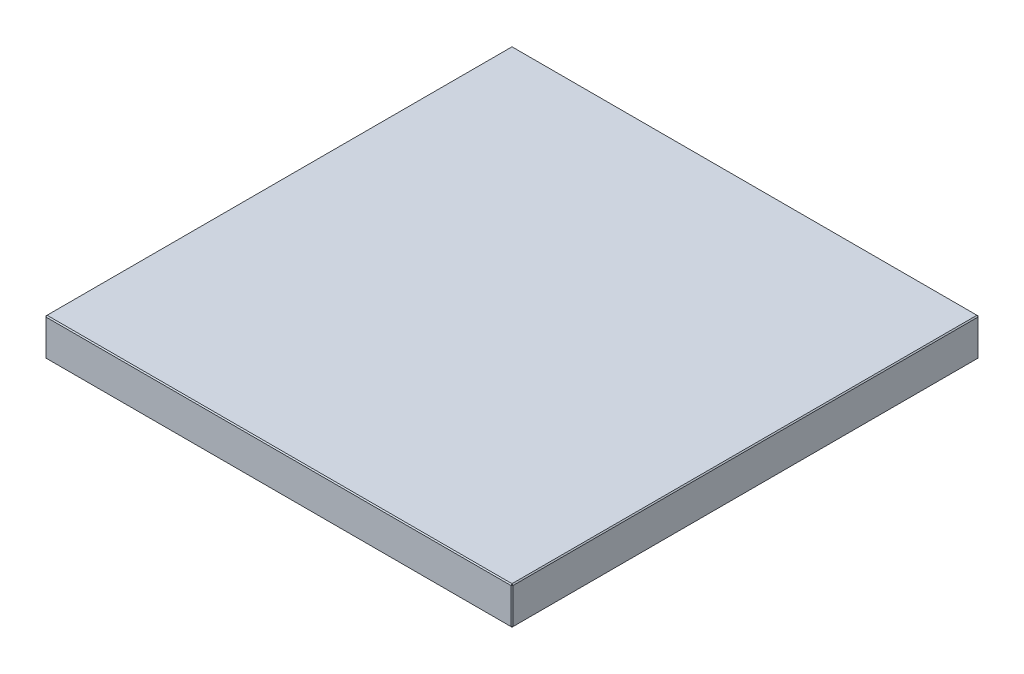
ISO-10303-21;
HEADER;
FILE_DESCRIPTION(('STEP AP214'),'2;1');
FILE_NAME('part.step','',(''),(''),'','','');
FILE_SCHEMA(('AUTOMOTIVE_DESIGN { 1 0 10303 214 1 1 1 1 }'));
ENDSEC;
DATA;
#1=APPLICATION_CONTEXT('core data for automotive mechanical design processes');
#2=APPLICATION_PROTOCOL_DEFINITION('international standard','automotive_design',2000,#1);
#3=PRODUCT_CONTEXT('',#1,'mechanical');
#4=PRODUCT('Part','Part','',(#3));
#5=PRODUCT_RELATED_PRODUCT_CATEGORY('part','',(#4));
#6=PRODUCT_DEFINITION_FORMATION('','',#4);
#7=PRODUCT_DEFINITION_CONTEXT('part definition',#1,'design');
#8=PRODUCT_DEFINITION('design','',#6,#7);
#9=PRODUCT_DEFINITION_SHAPE('','',#8);
#10=(LENGTH_UNIT() NAMED_UNIT(*) SI_UNIT(.MILLI.,.METRE.));
#11=(NAMED_UNIT(*) PLANE_ANGLE_UNIT() SI_UNIT($,.RADIAN.));
#12=(NAMED_UNIT(*) SI_UNIT($,.STERADIAN.) SOLID_ANGLE_UNIT());
#13=UNCERTAINTY_MEASURE_WITH_UNIT(LENGTH_MEASURE(1.E-05),#10,'distance_accuracy_value','');
#14=(GEOMETRIC_REPRESENTATION_CONTEXT(3) GLOBAL_UNCERTAINTY_ASSIGNED_CONTEXT((#13)) GLOBAL_UNIT_ASSIGNED_CONTEXT((#10,
#11,#12)) REPRESENTATION_CONTEXT('',''));
#15=CARTESIAN_POINT('',(0.,0.,0.));
#16=DIRECTION('',(0.,0.,1.));
#17=DIRECTION('',(1.,0.,0.));
#18=AXIS2_PLACEMENT_3D('',#15,#16,#17);
#19=CARTESIAN_POINT('',(-223.,36.,223.));
#20=DIRECTION('',(1.,0.,0.));
#21=DIRECTION('',(0.,0.,-1.));
#22=AXIS2_PLACEMENT_3D('',#19,#20,#21);
#23=PLANE('',#22);
#24=DIRECTION('',(0.,-1.,0.));
#25=VECTOR('',#24,1.);
#26=CARTESIAN_POINT('',(-223.,36.,-222.));
#27=LINE('',#26,#25);
#28=CARTESIAN_POINT('',(-223.,35.,-222.));
#29=VERTEX_POINT('',#28);
#30=CARTESIAN_POINT('',(-223.,1.,-222.));
#31=VERTEX_POINT('',#30);
#32=EDGE_CURVE('E114',#29,#31,#27,.T.);
#33=ORIENTED_EDGE('',*,*,#32,.T.);
#34=DIRECTION('',(0.,0.,1.));
#35=VECTOR('',#34,1.);
#36=CARTESIAN_POINT('',(-223.,1.,223.));
#37=LINE('',#36,#35);
#38=CARTESIAN_POINT('',(-223.,1.,222.));
#39=VERTEX_POINT('',#38);
#40=EDGE_CURVE('E110',#31,#39,#37,.T.);
#41=ORIENTED_EDGE('',*,*,#40,.T.);
#42=DIRECTION('',(0.,1.,0.));
#43=VECTOR('',#42,1.);
#44=CARTESIAN_POINT('',(-223.,36.,222.));
#45=LINE('',#44,#43);
#46=CARTESIAN_POINT('',(-223.,35.,222.));
#47=VERTEX_POINT('',#46);
#48=EDGE_CURVE('E103',#39,#47,#45,.T.);
#49=ORIENTED_EDGE('',*,*,#48,.T.);
#50=DIRECTION('',(0.,0.,-1.));
#51=VECTOR('',#50,1.);
#52=CARTESIAN_POINT('',(-223.,35.,-223.));
#53=LINE('',#52,#51);
#54=EDGE_CURVE('E107',#47,#29,#53,.T.);
#55=ORIENTED_EDGE('',*,*,#54,.T.);
#56=EDGE_LOOP('',(#33,#41,#49,#55));
#57=FACE_BOUND('',#56,.T.);
#58=ADVANCED_FACE('F15',(#57),#23,.F.);
#59=CARTESIAN_POINT('',(223.,36.,223.));
#60=DIRECTION('',(0.,0.,-1.));
#61=DIRECTION('',(-1.,0.,0.));
#62=AXIS2_PLACEMENT_3D('',#59,#60,#61);
#63=PLANE('',#62);
#64=DIRECTION('',(-1.,0.,0.));
#65=VECTOR('',#64,1.);
#66=CARTESIAN_POINT('',(-223.,35.,223.));
#67=LINE('',#66,#65);
#68=CARTESIAN_POINT('',(222.,35.,223.));
#69=VERTEX_POINT('',#68);
#70=CARTESIAN_POINT('',(-222.,35.,223.));
#71=VERTEX_POINT('',#70);
#72=EDGE_CURVE('E164',#69,#71,#67,.T.);
#73=ORIENTED_EDGE('',*,*,#72,.T.);
#74=DIRECTION('',(0.,-1.,0.));
#75=VECTOR('',#74,1.);
#76=CARTESIAN_POINT('',(-222.,36.,223.));
#77=LINE('',#76,#75);
#78=CARTESIAN_POINT('',(-222.,1.,223.));
#79=VERTEX_POINT('',#78);
#80=EDGE_CURVE('E122',#71,#79,#77,.T.);
#81=ORIENTED_EDGE('',*,*,#80,.T.);
#82=DIRECTION('',(1.,0.,0.));
#83=VECTOR('',#82,1.);
#84=CARTESIAN_POINT('',(223.,1.,223.));
#85=LINE('',#84,#83);
#86=CARTESIAN_POINT('',(222.,1.,223.));
#87=VERTEX_POINT('',#86);
#88=EDGE_CURVE('E168',#79,#87,#85,.T.);
#89=ORIENTED_EDGE('',*,*,#88,.T.);
#90=DIRECTION('',(0.,1.,0.));
#91=VECTOR('',#90,1.);
#92=CARTESIAN_POINT('',(222.,36.,223.));
#93=LINE('',#92,#91);
#94=EDGE_CURVE('E166',#87,#69,#93,.T.);
#95=ORIENTED_EDGE('',*,*,#94,.T.);
#96=EDGE_LOOP('',(#73,#81,#89,#95));
#97=FACE_BOUND('',#96,.T.);
#98=ADVANCED_FACE('F275',(#97),#63,.F.);
#99=CARTESIAN_POINT('',(223.,36.,223.));
#100=DIRECTION('',(-1.,0.,0.));
#101=DIRECTION('',(0.,0.,1.));
#102=AXIS2_PLACEMENT_3D('',#99,#100,#101);
#103=PLANE('',#102);
#104=DIRECTION('',(0.,0.,-1.));
#105=VECTOR('',#104,1.);
#106=CARTESIAN_POINT('',(223.,1.,223.));
#107=LINE('',#106,#105);
#108=CARTESIAN_POINT('',(223.,1.,222.));
#109=VERTEX_POINT('',#108);
#110=CARTESIAN_POINT('',(223.,1.,-222.));
#111=VERTEX_POINT('',#110);
#112=EDGE_CURVE('E159',#109,#111,#107,.T.);
#113=ORIENTED_EDGE('',*,*,#112,.T.);
#114=DIRECTION('',(0.,1.,0.));
#115=VECTOR('',#114,1.);
#116=CARTESIAN_POINT('',(223.,36.,-222.));
#117=LINE('',#116,#115);
#118=CARTESIAN_POINT('',(223.,35.,-222.));
#119=VERTEX_POINT('',#118);
#120=EDGE_CURVE('E161',#111,#119,#117,.T.);
#121=ORIENTED_EDGE('',*,*,#120,.T.);
#122=DIRECTION('',(0.,0.,1.));
#123=VECTOR('',#122,1.);
#124=CARTESIAN_POINT('',(223.,35.,223.));
#125=LINE('',#124,#123);
#126=CARTESIAN_POINT('',(223.,35.,222.));
#127=VERTEX_POINT('',#126);
#128=EDGE_CURVE('E155',#119,#127,#125,.T.);
#129=ORIENTED_EDGE('',*,*,#128,.T.);
#130=DIRECTION('',(0.,-1.,0.));
#131=VECTOR('',#130,1.);
#132=CARTESIAN_POINT('',(223.,36.,222.));
#133=LINE('',#132,#131);
#134=EDGE_CURVE('E157',#127,#109,#133,.T.);
#135=ORIENTED_EDGE('',*,*,#134,.T.);
#136=EDGE_LOOP('',(#113,#121,#129,#135));
#137=FACE_BOUND('',#136,.T.);
#138=ADVANCED_FACE('F254',(#137),#103,.F.);
#139=CARTESIAN_POINT('',(223.,36.,-223.));
#140=DIRECTION('',(0.,0.,1.));
#141=DIRECTION('',(1.,0.,0.));
#142=AXIS2_PLACEMENT_3D('',#139,#140,#141);
#143=PLANE('',#142);
#144=DIRECTION('',(0.,-1.,0.));
#145=VECTOR('',#144,1.);
#146=CARTESIAN_POINT('',(222.,36.,-223.));
#147=LINE('',#146,#145);
#148=CARTESIAN_POINT('',(222.,35.,-223.));
#149=VERTEX_POINT('',#148);
#150=CARTESIAN_POINT('',(222.,1.,-223.));
#151=VERTEX_POINT('',#150);
#152=EDGE_CURVE('E148',#149,#151,#147,.T.);
#153=ORIENTED_EDGE('',*,*,#152,.T.);
#154=DIRECTION('',(-1.,0.,0.));
#155=VECTOR('',#154,1.);
#156=CARTESIAN_POINT('',(223.,1.,-223.));
#157=LINE('',#156,#155);
#158=CARTESIAN_POINT('',(-222.,1.,-223.));
#159=VERTEX_POINT('',#158);
#160=EDGE_CURVE('E153',#151,#159,#157,.T.);
#161=ORIENTED_EDGE('',*,*,#160,.T.);
#162=DIRECTION('',(0.,1.,0.));
#163=VECTOR('',#162,1.);
#164=CARTESIAN_POINT('',(-222.,36.,-223.));
#165=LINE('',#164,#163);
#166=CARTESIAN_POINT('',(-222.,35.,-223.));
#167=VERTEX_POINT('',#166);
#168=EDGE_CURVE('E150',#159,#167,#165,.T.);
#169=ORIENTED_EDGE('',*,*,#168,.T.);
#170=DIRECTION('',(1.,0.,0.));
#171=VECTOR('',#170,1.);
#172=CARTESIAN_POINT('',(223.,35.,-223.));
#173=LINE('',#172,#171);
#174=EDGE_CURVE('E146',#167,#149,#173,.T.);
#175=ORIENTED_EDGE('',*,*,#174,.T.);
#176=EDGE_LOOP('',(#153,#161,#169,#175));
#177=FACE_BOUND('',#176,.T.);
#178=ADVANCED_FACE('F284',(#177),#143,.F.);
#179=CARTESIAN_POINT('',(0.,36.,0.));
#180=DIRECTION('',(0.,1.,0.));
#181=DIRECTION('',(0.,0.,1.));
#182=AXIS2_PLACEMENT_3D('',#179,#180,#181);
#183=PLANE('',#182);
#184=DIRECTION('',(0.,0.,-1.));
#185=VECTOR('',#184,1.);
#186=CARTESIAN_POINT('',(222.,36.,-223.));
#187=LINE('',#186,#185);
#188=CARTESIAN_POINT('',(222.,36.,222.));
#189=VERTEX_POINT('',#188);
#190=CARTESIAN_POINT('',(222.,36.,-222.));
#191=VERTEX_POINT('',#190);
#192=EDGE_CURVE('E24',#189,#191,#187,.T.);
#193=ORIENTED_EDGE('',*,*,#192,.T.);
#194=DIRECTION('',(-1.,0.,0.));
#195=VECTOR('',#194,1.);
#196=CARTESIAN_POINT('',(-223.,36.,-222.));
#197=LINE('',#196,#195);
#198=CARTESIAN_POINT('',(-222.,36.,-222.));
#199=VERTEX_POINT('',#198);
#200=EDGE_CURVE('E9',#191,#199,#197,.T.);
#201=ORIENTED_EDGE('',*,*,#200,.T.);
#202=DIRECTION('',(0.,0.,1.));
#203=VECTOR('',#202,1.);
#204=CARTESIAN_POINT('',(-222.,36.,223.));
#205=LINE('',#204,#203);
#206=CARTESIAN_POINT('',(-222.,36.,222.));
#207=VERTEX_POINT('',#206);
#208=EDGE_CURVE('E180',#199,#207,#205,.T.);
#209=ORIENTED_EDGE('',*,*,#208,.T.);
#210=DIRECTION('',(1.,0.,0.));
#211=VECTOR('',#210,1.);
#212=CARTESIAN_POINT('',(223.,36.,222.));
#213=LINE('',#212,#211);
#214=EDGE_CURVE('E35',#207,#189,#213,.T.);
#215=ORIENTED_EDGE('',*,*,#214,.T.);
#216=EDGE_LOOP('',(#193,#201,#209,#215));
#217=FACE_BOUND('',#216,.T.);
#218=ADVANCED_FACE('F350',(#217),#183,.T.);
#219=CARTESIAN_POINT('',(0.,0.,0.));
#220=DIRECTION('',(0.,1.,0.));
#221=DIRECTION('',(0.,0.,1.));
#222=AXIS2_PLACEMENT_3D('',#219,#220,#221);
#223=PLANE('',#222);
#224=DIRECTION('',(0.,0.,1.));
#225=VECTOR('',#224,1.);
#226=CARTESIAN_POINT('',(222.,0.,0.));
#227=LINE('',#226,#225);
#228=CARTESIAN_POINT('',(222.,0.,-222.));
#229=VERTEX_POINT('',#228);
#230=CARTESIAN_POINT('',(222.,0.,222.));
#231=VERTEX_POINT('',#230);
#232=EDGE_CURVE('E171',#229,#231,#227,.T.);
#233=ORIENTED_EDGE('',*,*,#232,.T.);
#234=DIRECTION('',(-1.,0.,0.));
#235=VECTOR('',#234,1.);
#236=CARTESIAN_POINT('',(0.,0.,222.));
#237=LINE('',#236,#235);
#238=CARTESIAN_POINT('',(-222.,0.,222.));
#239=VERTEX_POINT('',#238);
#240=EDGE_CURVE('E177',#231,#239,#237,.T.);
#241=ORIENTED_EDGE('',*,*,#240,.T.);
#242=DIRECTION('',(0.,0.,-1.));
#243=VECTOR('',#242,1.);
#244=CARTESIAN_POINT('',(-222.,0.,0.));
#245=LINE('',#244,#243);
#246=CARTESIAN_POINT('',(-222.,0.,-222.));
#247=VERTEX_POINT('',#246);
#248=EDGE_CURVE('E175',#239,#247,#245,.T.);
#249=ORIENTED_EDGE('',*,*,#248,.T.);
#250=DIRECTION('',(1.,0.,0.));
#251=VECTOR('',#250,1.);
#252=CARTESIAN_POINT('',(0.,0.,-222.));
#253=LINE('',#252,#251);
#254=EDGE_CURVE('E173',#247,#229,#253,.T.);
#255=ORIENTED_EDGE('',*,*,#254,.T.);
#256=EDGE_LOOP('',(#233,#241,#249,#255));
#257=FACE_BOUND('',#256,.T.);
#258=ADVANCED_FACE('F246',(#257),#223,.F.);
#259=CARTESIAN_POINT('',(223.,36.,222.));
#260=DIRECTION('',(-0.707106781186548,0.,-0.707106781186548));
#261=DIRECTION('',(0.,-1.,0.));
#262=AXIS2_PLACEMENT_3D('',#259,#260,#261);
#263=PLANE('',#262);
#264=DIRECTION('',(-0.707106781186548,0.,0.707106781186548));
#265=VECTOR('',#264,1.);
#266=CARTESIAN_POINT('',(222.,35.,223.));
#267=LINE('',#266,#265);
#268=EDGE_CURVE('E19',#69,#127,#267,.F.);
#269=ORIENTED_EDGE('',*,*,#268,.F.);
#270=ORIENTED_EDGE('',*,*,#94,.F.);
#271=DIRECTION('',(0.707106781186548,0.,-0.707106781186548));
#272=VECTOR('',#271,1.);
#273=CARTESIAN_POINT('',(222.,1.,223.));
#274=LINE('',#273,#272);
#275=EDGE_CURVE('E142',#109,#87,#274,.F.);
#276=ORIENTED_EDGE('',*,*,#275,.F.);
#277=ORIENTED_EDGE('',*,*,#134,.F.);
#278=EDGE_LOOP('',(#269,#270,#276,#277));
#279=FACE_BOUND('',#278,.T.);
#280=ADVANCED_FACE('F17',(#279),#263,.F.);
#281=CARTESIAN_POINT('',(222.,35.,223.));
#282=DIRECTION('',(0.577350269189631,0.577350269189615,0.577350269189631));
#283=DIRECTION('',(0.707106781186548,0.,-0.707106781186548));
#284=AXIS2_PLACEMENT_3D('',#281,#282,#283);
#285=PLANE('',#284);
#286=DIRECTION('',(0.,-0.707106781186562,0.707106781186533));
#287=VECTOR('',#286,1.);
#288=CARTESIAN_POINT('',(222.,35.,223.));
#289=LINE('',#288,#287);
#290=EDGE_CURVE('E226',#69,#189,#289,.F.);
#291=ORIENTED_EDGE('',*,*,#290,.F.);
#292=ORIENTED_EDGE('',*,*,#268,.T.);
#293=DIRECTION('',(-0.707106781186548,0.707106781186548,0.));
#294=VECTOR('',#293,1.);
#295=CARTESIAN_POINT('',(222.5,35.5,222.));
#296=LINE('',#295,#294);
#297=EDGE_CURVE('E228',#189,#127,#296,.F.);
#298=ORIENTED_EDGE('',*,*,#297,.F.);
#299=EDGE_LOOP('',(#291,#292,#298));
#300=FACE_BOUND('',#299,.T.);
#301=ADVANCED_FACE('F270',(#300),#285,.T.);
#302=CARTESIAN_POINT('',(222.,1.,223.));
#303=DIRECTION('',(0.577350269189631,-0.577350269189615,0.577350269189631));
#304=DIRECTION('',(0.707106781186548,0.,-0.707106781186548));
#305=AXIS2_PLACEMENT_3D('',#302,#303,#304);
#306=PLANE('',#305);
#307=DIRECTION('',(-0.707106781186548,-0.707106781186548,0.));
#308=VECTOR('',#307,1.);
#309=CARTESIAN_POINT('',(222.5,0.499999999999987,222.));
#310=LINE('',#309,#308);
#311=EDGE_CURVE('E220',#109,#231,#310,.T.);
#312=ORIENTED_EDGE('',*,*,#311,.F.);
#313=ORIENTED_EDGE('',*,*,#275,.T.);
#314=DIRECTION('',(0.,0.707106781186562,0.707106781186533));
#315=VECTOR('',#314,1.);
#316=CARTESIAN_POINT('',(222.,1.,223.));
#317=LINE('',#316,#315);
#318=EDGE_CURVE('E223',#231,#87,#317,.T.);
#319=ORIENTED_EDGE('',*,*,#318,.F.);
#320=EDGE_LOOP('',(#312,#313,#319));
#321=FACE_BOUND('',#320,.T.);
#322=ADVANCED_FACE('F235',(#321),#306,.T.);
#323=CARTESIAN_POINT('',(222.,36.,0.));
#324=DIRECTION('',(0.707106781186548,0.707106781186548,0.));
#325=DIRECTION('',(0.,0.,1.));
#326=AXIS2_PLACEMENT_3D('',#323,#324,#325);
#327=PLANE('',#326);
#328=ORIENTED_EDGE('',*,*,#297,.T.);
#329=ORIENTED_EDGE('',*,*,#128,.F.);
#330=DIRECTION('',(0.707106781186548,-0.707106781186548,0.));
#331=VECTOR('',#330,1.);
#332=CARTESIAN_POINT('',(223.,35.,-222.));
#333=LINE('',#332,#331);
#334=EDGE_CURVE('E215',#191,#119,#333,.T.);
#335=ORIENTED_EDGE('',*,*,#334,.F.);
#336=ORIENTED_EDGE('',*,*,#192,.F.);
#337=EDGE_LOOP('',(#328,#329,#335,#336));
#338=FACE_BOUND('',#337,.T.);
#339=ADVANCED_FACE('F265',(#338),#327,.T.);
#340=CARTESIAN_POINT('',(0.,36.,222.));
#341=DIRECTION('',(0.,0.707106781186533,0.707106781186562));
#342=DIRECTION('',(-1.,0.,0.));
#343=AXIS2_PLACEMENT_3D('',#340,#341,#342);
#344=PLANE('',#343);
#345=ORIENTED_EDGE('',*,*,#290,.T.);
#346=ORIENTED_EDGE('',*,*,#214,.F.);
#347=DIRECTION('',(0.,0.707106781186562,-0.707106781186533));
#348=VECTOR('',#347,1.);
#349=CARTESIAN_POINT('',(-222.,35.5,222.5));
#350=LINE('',#349,#348);
#351=EDGE_CURVE('E126',#71,#207,#350,.T.);
#352=ORIENTED_EDGE('',*,*,#351,.F.);
#353=ORIENTED_EDGE('',*,*,#72,.F.);
#354=EDGE_LOOP('',(#345,#346,#352,#353));
#355=FACE_BOUND('',#354,.T.);
#356=ADVANCED_FACE('F273',(#355),#344,.T.);
#357=CARTESIAN_POINT('',(-222.,36.,223.));
#358=DIRECTION('',(0.707106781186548,0.,-0.707106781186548));
#359=DIRECTION('',(0.,-1.,0.));
#360=AXIS2_PLACEMENT_3D('',#357,#358,#359);
#361=PLANE('',#360);
#362=DIRECTION('',(0.707106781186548,0.,0.707106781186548));
#363=VECTOR('',#362,1.);
#364=CARTESIAN_POINT('',(-222.,1.,223.));
#365=LINE('',#364,#363);
#366=EDGE_CURVE('E127',#79,#39,#365,.F.);
#367=ORIENTED_EDGE('',*,*,#366,.F.);
#368=ORIENTED_EDGE('',*,*,#80,.F.);
#369=DIRECTION('',(-0.707106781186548,0.,-0.707106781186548));
#370=VECTOR('',#369,1.);
#371=CARTESIAN_POINT('',(-223.,35.,222.));
#372=LINE('',#371,#370);
#373=EDGE_CURVE('E118',#47,#71,#372,.F.);
#374=ORIENTED_EDGE('',*,*,#373,.F.);
#375=ORIENTED_EDGE('',*,*,#48,.F.);
#376=EDGE_LOOP('',(#367,#368,#374,#375));
#377=FACE_BOUND('',#376,.T.);
#378=ADVANCED_FACE('F120',(#377),#361,.F.);
#379=CARTESIAN_POINT('',(223.,1.,223.));
#380=DIRECTION('',(0.,0.707106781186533,-0.707106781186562));
#381=DIRECTION('',(1.,0.,0.));
#382=AXIS2_PLACEMENT_3D('',#379,#380,#381);
#383=PLANE('',#382);
#384=ORIENTED_EDGE('',*,*,#318,.T.);
#385=ORIENTED_EDGE('',*,*,#88,.F.);
#386=DIRECTION('',(0.,-0.707106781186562,-0.707106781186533));
#387=VECTOR('',#386,1.);
#388=CARTESIAN_POINT('',(-222.,1.,223.));
#389=LINE('',#388,#387);
#390=EDGE_CURVE('E211',#239,#79,#389,.F.);
#391=ORIENTED_EDGE('',*,*,#390,.F.);
#392=ORIENTED_EDGE('',*,*,#240,.F.);
#393=EDGE_LOOP('',(#384,#385,#391,#392));
#394=FACE_BOUND('',#393,.T.);
#395=ADVANCED_FACE('F243',(#394),#383,.F.);
#396=CARTESIAN_POINT('',(223.,1.,223.));
#397=DIRECTION('',(-0.707106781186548,0.707106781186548,0.));
#398=DIRECTION('',(0.,0.,-1.));
#399=AXIS2_PLACEMENT_3D('',#396,#397,#398);
#400=PLANE('',#399);
#401=ORIENTED_EDGE('',*,*,#311,.T.);
#402=ORIENTED_EDGE('',*,*,#232,.F.);
#403=DIRECTION('',(0.707106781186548,0.707106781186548,0.));
#404=VECTOR('',#403,1.);
#405=CARTESIAN_POINT('',(222.5,0.499999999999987,-222.));
#406=LINE('',#405,#404);
#407=EDGE_CURVE('E208',#111,#229,#406,.F.);
#408=ORIENTED_EDGE('',*,*,#407,.F.);
#409=ORIENTED_EDGE('',*,*,#112,.F.);
#410=EDGE_LOOP('',(#401,#402,#408,#409));
#411=FACE_BOUND('',#410,.T.);
#412=ADVANCED_FACE('F251',(#411),#400,.F.);
#413=CARTESIAN_POINT('',(222.,36.,-223.));
#414=DIRECTION('',(-0.707106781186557,0.,0.707106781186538));
#415=DIRECTION('',(0.,-1.,0.));
#416=AXIS2_PLACEMENT_3D('',#413,#414,#415);
#417=PLANE('',#416);
#418=DIRECTION('',(0.707106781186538,0.,0.707106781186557));
#419=VECTOR('',#418,1.);
#420=CARTESIAN_POINT('',(223.,35.,-222.));
#421=LINE('',#420,#419);
#422=EDGE_CURVE('E217',#119,#149,#421,.F.);
#423=ORIENTED_EDGE('',*,*,#422,.F.);
#424=ORIENTED_EDGE('',*,*,#120,.F.);
#425=DIRECTION('',(-0.707106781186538,0.,-0.707106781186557));
#426=VECTOR('',#425,1.);
#427=CARTESIAN_POINT('',(222.,1.,-223.));
#428=LINE('',#427,#426);
#429=EDGE_CURVE('E205',#151,#111,#428,.F.);
#430=ORIENTED_EDGE('',*,*,#429,.F.);
#431=ORIENTED_EDGE('',*,*,#152,.F.);
#432=EDGE_LOOP('',(#423,#424,#430,#431));
#433=FACE_BOUND('',#432,.T.);
#434=ADVANCED_FACE('F258',(#433),#417,.F.);
#435=CARTESIAN_POINT('',(223.,35.,-222.));
#436=DIRECTION('',(0.577350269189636,0.57735026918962,-0.57735026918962));
#437=DIRECTION('',(-0.707106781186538,0.,-0.707106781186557));
#438=AXIS2_PLACEMENT_3D('',#435,#436,#437);
#439=PLANE('',#438);
#440=ORIENTED_EDGE('',*,*,#334,.T.);
#441=ORIENTED_EDGE('',*,*,#422,.T.);
#442=DIRECTION('',(0.,0.707106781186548,0.707106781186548));
#443=VECTOR('',#442,1.);
#444=CARTESIAN_POINT('',(222.,35.5,-222.5));
#445=LINE('',#444,#443);
#446=EDGE_CURVE('E134',#191,#149,#445,.F.);
#447=ORIENTED_EDGE('',*,*,#446,.F.);
#448=EDGE_LOOP('',(#440,#441,#447));
#449=FACE_BOUND('',#448,.T.);
#450=ADVANCED_FACE('F325',(#449),#439,.T.);
#451=CARTESIAN_POINT('',(-223.,35.,222.));
#452=DIRECTION('',(-0.577350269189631,0.577350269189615,0.577350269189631));
#453=DIRECTION('',(0.707106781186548,0.,0.707106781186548));
#454=AXIS2_PLACEMENT_3D('',#451,#452,#453);
#455=PLANE('',#454);
#456=ORIENTED_EDGE('',*,*,#373,.T.);
#457=ORIENTED_EDGE('',*,*,#351,.T.);
#458=DIRECTION('',(-0.707106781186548,-0.707106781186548,0.));
#459=VECTOR('',#458,1.);
#460=CARTESIAN_POINT('',(-223.,35.,222.));
#461=LINE('',#460,#459);
#462=EDGE_CURVE('E130',#47,#207,#461,.F.);
#463=ORIENTED_EDGE('',*,*,#462,.F.);
#464=EDGE_LOOP('',(#456,#457,#463));
#465=FACE_BOUND('',#464,.T.);
#466=ADVANCED_FACE('F131',(#465),#455,.T.);
#467=CARTESIAN_POINT('',(-222.,1.,223.));
#468=DIRECTION('',(-0.577350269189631,-0.577350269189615,0.577350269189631));
#469=DIRECTION('',(0.707106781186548,0.,0.707106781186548));
#470=AXIS2_PLACEMENT_3D('',#467,#468,#469);
#471=PLANE('',#470);
#472=ORIENTED_EDGE('',*,*,#390,.T.);
#473=ORIENTED_EDGE('',*,*,#366,.T.);
#474=DIRECTION('',(-0.707106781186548,0.707106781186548,0.));
#475=VECTOR('',#474,1.);
#476=CARTESIAN_POINT('',(-222.5,0.499999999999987,222.));
#477=LINE('',#476,#475);
#478=EDGE_CURVE('E135',#239,#39,#477,.T.);
#479=ORIENTED_EDGE('',*,*,#478,.F.);
#480=EDGE_LOOP('',(#472,#473,#479));
#481=FACE_BOUND('',#480,.T.);
#482=ADVANCED_FACE('F318',(#481),#471,.T.);
#483=CARTESIAN_POINT('',(222.,1.,-223.));
#484=DIRECTION('',(0.577350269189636,-0.57735026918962,-0.57735026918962));
#485=DIRECTION('',(-0.707106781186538,0.,-0.707106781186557));
#486=AXIS2_PLACEMENT_3D('',#483,#484,#485);
#487=PLANE('',#486);
#488=ORIENTED_EDGE('',*,*,#429,.T.);
#489=ORIENTED_EDGE('',*,*,#407,.T.);
#490=DIRECTION('',(0.,-0.707106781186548,0.707106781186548));
#491=VECTOR('',#490,1.);
#492=CARTESIAN_POINT('',(222.,1.,-223.));
#493=LINE('',#492,#491);
#494=EDGE_CURVE('E198',#151,#229,#493,.T.);
#495=ORIENTED_EDGE('',*,*,#494,.F.);
#496=EDGE_LOOP('',(#488,#489,#495));
#497=FACE_BOUND('',#496,.T.);
#498=ADVANCED_FACE('F314',(#497),#487,.T.);
#499=CARTESIAN_POINT('',(0.,36.,-222.));
#500=DIRECTION('',(0.,0.707106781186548,-0.707106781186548));
#501=DIRECTION('',(1.,0.,0.));
#502=AXIS2_PLACEMENT_3D('',#499,#500,#501);
#503=PLANE('',#502);
#504=ORIENTED_EDGE('',*,*,#446,.T.);
#505=ORIENTED_EDGE('',*,*,#174,.F.);
#506=DIRECTION('',(0.,-0.707106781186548,-0.707106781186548));
#507=VECTOR('',#506,1.);
#508=CARTESIAN_POINT('',(-222.,35.,-223.));
#509=LINE('',#508,#507);
#510=EDGE_CURVE('E195',#199,#167,#509,.T.);
#511=ORIENTED_EDGE('',*,*,#510,.F.);
#512=ORIENTED_EDGE('',*,*,#200,.F.);
#513=EDGE_LOOP('',(#504,#505,#511,#512));
#514=FACE_BOUND('',#513,.T.);
#515=ADVANCED_FACE('F311',(#514),#503,.T.);
#516=CARTESIAN_POINT('',(-222.,36.,0.));
#517=DIRECTION('',(-0.707106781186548,0.707106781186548,0.));
#518=DIRECTION('',(0.,0.,-1.));
#519=AXIS2_PLACEMENT_3D('',#516,#517,#518);
#520=PLANE('',#519);
#521=ORIENTED_EDGE('',*,*,#462,.T.);
#522=ORIENTED_EDGE('',*,*,#208,.F.);
#523=DIRECTION('',(0.707106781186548,0.707106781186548,0.));
#524=VECTOR('',#523,1.);
#525=CARTESIAN_POINT('',(-222.5,35.5,-222.));
#526=LINE('',#525,#524);
#527=EDGE_CURVE('E138',#29,#199,#526,.T.);
#528=ORIENTED_EDGE('',*,*,#527,.F.);
#529=ORIENTED_EDGE('',*,*,#54,.F.);
#530=EDGE_LOOP('',(#521,#522,#528,#529));
#531=FACE_BOUND('',#530,.T.);
#532=ADVANCED_FACE('F137',(#531),#520,.T.);
#533=CARTESIAN_POINT('',(-223.,1.,223.));
#534=DIRECTION('',(0.707106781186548,0.707106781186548,0.));
#535=DIRECTION('',(0.,0.,1.));
#536=AXIS2_PLACEMENT_3D('',#533,#534,#535);
#537=PLANE('',#536);
#538=ORIENTED_EDGE('',*,*,#478,.T.);
#539=ORIENTED_EDGE('',*,*,#40,.F.);
#540=DIRECTION('',(0.707106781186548,-0.707106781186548,0.));
#541=VECTOR('',#540,1.);
#542=CARTESIAN_POINT('',(-223.,1.,-222.));
#543=LINE('',#542,#541);
#544=EDGE_CURVE('E191',#247,#31,#543,.F.);
#545=ORIENTED_EDGE('',*,*,#544,.F.);
#546=ORIENTED_EDGE('',*,*,#248,.F.);
#547=EDGE_LOOP('',(#538,#539,#545,#546));
#548=FACE_BOUND('',#547,.T.);
#549=ADVANCED_FACE('F304',(#548),#537,.F.);
#550=CARTESIAN_POINT('',(223.,1.,-223.));
#551=DIRECTION('',(0.,0.707106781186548,0.707106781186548));
#552=DIRECTION('',(-1.,0.,0.));
#553=AXIS2_PLACEMENT_3D('',#550,#551,#552);
#554=PLANE('',#553);
#555=ORIENTED_EDGE('',*,*,#494,.T.);
#556=ORIENTED_EDGE('',*,*,#254,.F.);
#557=DIRECTION('',(0.,0.707106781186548,-0.707106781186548));
#558=VECTOR('',#557,1.);
#559=CARTESIAN_POINT('',(-222.,0.5,-222.5));
#560=LINE('',#559,#558);
#561=EDGE_CURVE('E188',#159,#247,#560,.F.);
#562=ORIENTED_EDGE('',*,*,#561,.F.);
#563=ORIENTED_EDGE('',*,*,#160,.F.);
#564=EDGE_LOOP('',(#555,#556,#562,#563));
#565=FACE_BOUND('',#564,.T.);
#566=ADVANCED_FACE('F300',(#565),#554,.F.);
#567=CARTESIAN_POINT('',(-222.,35.,-223.));
#568=DIRECTION('',(-0.577350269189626,0.577350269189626,-0.577350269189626));
#569=DIRECTION('',(-0.707106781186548,0.,0.707106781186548));
#570=AXIS2_PLACEMENT_3D('',#567,#568,#569);
#571=PLANE('',#570);
#572=ORIENTED_EDGE('',*,*,#527,.T.);
#573=ORIENTED_EDGE('',*,*,#510,.T.);
#574=DIRECTION('',(0.707106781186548,0.,-0.707106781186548));
#575=VECTOR('',#574,1.);
#576=CARTESIAN_POINT('',(-222.,35.,-223.));
#577=LINE('',#576,#575);
#578=EDGE_CURVE('E186',#29,#167,#577,.T.);
#579=ORIENTED_EDGE('',*,*,#578,.F.);
#580=EDGE_LOOP('',(#572,#573,#579));
#581=FACE_BOUND('',#580,.T.);
#582=ADVANCED_FACE('F296',(#581),#571,.T.);
#583=CARTESIAN_POINT('',(-223.,1.,-222.));
#584=DIRECTION('',(-0.577350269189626,-0.577350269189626,-0.577350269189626));
#585=DIRECTION('',(-0.707106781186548,0.,0.707106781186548));
#586=AXIS2_PLACEMENT_3D('',#583,#584,#585);
#587=PLANE('',#586);
#588=ORIENTED_EDGE('',*,*,#561,.T.);
#589=ORIENTED_EDGE('',*,*,#544,.T.);
#590=DIRECTION('',(-0.707106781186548,0.,0.707106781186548));
#591=VECTOR('',#590,1.);
#592=CARTESIAN_POINT('',(-223.,1.,-222.));
#593=LINE('',#592,#591);
#594=EDGE_CURVE('E184',#159,#31,#593,.T.);
#595=ORIENTED_EDGE('',*,*,#594,.F.);
#596=EDGE_LOOP('',(#588,#589,#595));
#597=FACE_BOUND('',#596,.T.);
#598=ADVANCED_FACE('F292',(#597),#587,.T.);
#599=CARTESIAN_POINT('',(-223.,36.,-222.));
#600=DIRECTION('',(0.707106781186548,0.,0.707106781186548));
#601=DIRECTION('',(0.,-1.,0.));
#602=AXIS2_PLACEMENT_3D('',#599,#600,#601);
#603=PLANE('',#602);
#604=ORIENTED_EDGE('',*,*,#578,.T.);
#605=ORIENTED_EDGE('',*,*,#168,.F.);
#606=ORIENTED_EDGE('',*,*,#594,.T.);
#607=ORIENTED_EDGE('',*,*,#32,.F.);
#608=EDGE_LOOP('',(#604,#605,#606,#607));
#609=FACE_BOUND('',#608,.T.);
#610=ADVANCED_FACE('F289',(#609),#603,.F.);
#611=CLOSED_SHELL('',(#58,#98,#138,#178,#218,#258,#280,#301,#322,#339,#356,#378,#395,#412,#434,
#450,#466,#482,#498,#515,#532,#549,#566,#582,#598,#610));
#612=MANIFOLD_SOLID_BREP('B1',#611);
#613=ADVANCED_BREP_SHAPE_REPRESENTATION('',(#18,#612),#14);
#614=SHAPE_DEFINITION_REPRESENTATION(#9,#613);
ENDSEC;
END-ISO-10303-21;
